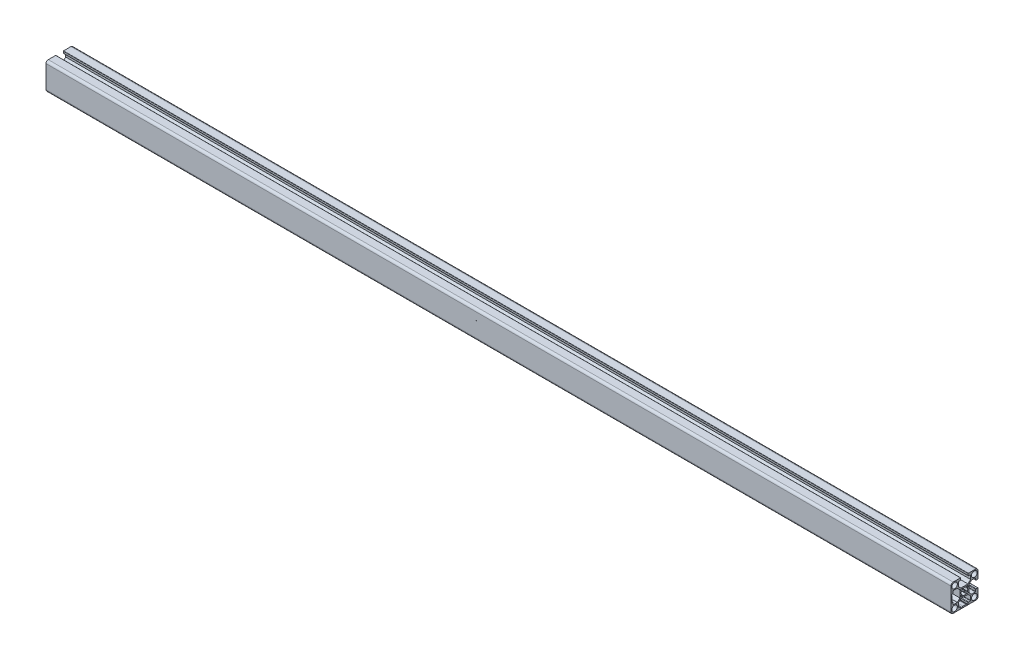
from build123d import *

# Parameters (mm, degrees)
MODEL7_R                            = 3.099999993
MODEL7_R_2                          = 3.1
F_30_SARJA_1_0007_30X30_2SS_1_DEPTH = 1000


with BuildPart() as part:
    # Model7 → 30-sarja 1.0007 30X30 2SS_1 (new body)
    with BuildSketch(Plane(origin=(0, 0, 0), x_dir=(0, 0, -1), z_dir=(1, 0, 0))):
        with BuildLine():
            Line((-4.099998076, 12.998506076), (-4.099998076, 14.698506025))
            ThreePointArc((-4.099998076, 14.698506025), (-4.187866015, 14.910638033), (-4.399998, 14.998506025))
            Line((-4.399998, 14.998506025), (-12.5, 14.998506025))
            ThreePointArc((-12.5, 14.998506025), (-14.267766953, 14.266272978), (-15, 12.498506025))
            Line((-15, 12.498506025), (-15, -12.501493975))
            ThreePointArc((-15, -12.501493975), (-14.267238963, -14.268295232), (-12.5, -15))
            Line((-12.5, -15), (12.5, -15))
            ThreePointArc((12.5, -15), (14.267238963, -14.268295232), (15, -12.501493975))
            Line((15, -12.501493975), (15, -4.401492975))
            ThreePointArc((15, -4.401492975), (14.912132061, -4.189360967), (14.700000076, -4.101492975))
            Line((14.700000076, -4.101492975), (12.999342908, -4.101492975))
            ThreePointArc((12.999342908, -4.101492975), (12.645789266, -4.247939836), (12.499342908, -4.601493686))
            Line((12.499342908, -4.601493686), (12.499342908, -6.500003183))
            ThreePointArc((12.499342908, -6.500003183), (12.411475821, -6.712132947), (12.199345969, -6.799999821))
            Line((12.199345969, -6.799999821), (7.859997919, -6.799999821))
            Line((7.859997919, -6.799999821), (4.999998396, -3.939999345))
            Line((4.999998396, -3.939999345), (4.999998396, 3.940000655))
            Line((4.999998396, 3.940000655), (7.859998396, 6.800000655))
            Line((7.859998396, 6.800000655), (12.20000515, 6.800000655))
            ThreePointArc((12.20000515, 6.800000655), (12.41213471, 6.712133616), (12.500001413, 6.500003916))
            Line((12.500001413, 6.500003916), (12.500001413, 4.598507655))
            ThreePointArc((12.500001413, 4.598507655), (12.646447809, 4.244953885), (13.000001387, 4.098507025))
            Line((13.000001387, 4.098507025), (14.70000213, 4.098507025))
            ThreePointArc((14.70000213, 4.098507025), (14.912661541, 4.186902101), (15, 4.399997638))
            Line((15, 4.399997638), (15, 12.5))
            ThreePointArc((15, 12.5), (14.267766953, 14.267766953), (12.5, 15))
            Line((12.5, 15), (4.400002, 15))
            ThreePointArc((4.400002, 15), (4.187869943, 14.912132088), (4.100001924, 14.700000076))
            Line((4.100001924, 14.700000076), (4.100001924, 13.000000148))
            ThreePointArc((4.100001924, 13.000000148), (4.246448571, 12.646446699), (4.600002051, 12.500000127))
            Line((4.600002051, 12.500000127), (6.500006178, 12.500000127))
            ThreePointArc((6.500006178, 12.500000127), (6.712664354, 12.411604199), (6.800000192, 12.198508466))
            Line((6.800000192, 12.198508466), (6.800000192, 7.858505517))
            Line((6.800000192, 7.858505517), (3.940000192, 4.998505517))
            Line((3.940000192, 4.998505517), (-3.939999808, 4.998505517))
            Line((-3.939999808, 4.998505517), (-6.799999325, 7.858506))
            Line((-6.799999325, 7.858506), (-6.799999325, 12.198508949))
            ThreePointArc((-6.799999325, 12.198508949), (-6.71213222, 12.41063888), (-6.500002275, 12.498505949))
            Line((-6.500002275, 12.498505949), (-4.599998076, 12.498505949))
            ThreePointArc((-4.599998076, 12.498505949), (-4.246444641, 12.644952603), (-4.099998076, 12.998506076))
        make_face()
        with Locations((10.899999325, -10.901493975)):
            Circle(MODEL7_R, mode=Mode.SUBTRACT)
        with Locations((-10.900000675, 10.898506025)):
            Circle(MODEL7_R_2, mode=Mode.SUBTRACT)
        with Locations((10.899999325, 10.898506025)):
            Circle(MODEL7_R, mode=Mode.SUBTRACT)
        with Locations((-10.900000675, -10.901493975)):
            Circle(MODEL7_R_2, mode=Mode.SUBTRACT)
        with BuildLine():
            Line((-3.363291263, -1.950571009), (-3.641600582, -2.228880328))
            Line((-3.641600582, -2.228880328), (-3.864716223, -3.278556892))
            ThreePointArc((-3.864716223, -3.278556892), (-3.725327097, -3.731700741), (-3.27028701, -3.864769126))
            Line((-3.27028701, -3.864769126), (-2.22738702, -3.64309389))
            Line((-2.22738702, -3.64309389), (-1.9490777, -3.364784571))
            ThreePointArc((-1.9490777, -3.364784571), (-1.78669092, -3.281069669), (-1.605855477, -3.307073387))
            ThreePointArc((-1.605855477, -3.307073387), (0.105812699, -3.674821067), (1.793484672, -3.209192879))
            Line((1.793484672, -3.209192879), (2.227385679, -3.643093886))
            Line((2.227385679, -3.643093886), (3.27028567, -3.864769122))
            ThreePointArc((3.27028567, -3.864769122), (3.725325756, -3.731700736), (3.864714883, -3.278556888))
            Line((3.864714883, -3.278556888), (3.641599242, -2.228880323))
            Line((3.641599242, -2.228880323), (3.363289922, -1.950571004))
            ThreePointArc((3.363289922, -1.950571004), (3.279575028, -1.788184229), (3.305578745, -1.607348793))
            ThreePointArc((3.305578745, -1.607348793), (3.675632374, 0.012150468), (3.294879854, 1.629167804))
            ThreePointArc((3.294879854, 1.629167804), (3.282114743, 1.798466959), (3.363289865, 1.947583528))
            Line((3.363289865, 1.947583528), (3.641599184, 2.225892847))
            Line((3.641599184, 2.225892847), (3.864714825, 3.275569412))
            ThreePointArc((3.864714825, 3.275569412), (3.699830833, 3.760183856), (3.195146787, 3.845810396))
            Line((3.195146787, 3.845810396), (2.227385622, 3.64010641))
            Line((2.227385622, 3.64010641), (1.949076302, 3.361797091))
            ThreePointArc((1.949076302, 3.361797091), (1.786665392, 3.278078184), (1.605810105, 3.30410748))
            ThreePointArc((1.605810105, 3.30410748), (-2.5227e-05, 3.673656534), (-1.605855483, 3.304085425))
            ThreePointArc((-1.605855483, 3.304085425), (-1.786690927, 3.278081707), (-1.949077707, 3.361796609))
            Line((-1.949077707, 3.361796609), (-2.227387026, 3.640105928))
            Line((-2.227387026, 3.640105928), (-3.270287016, 3.861781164))
            ThreePointArc((-3.270287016, 3.861781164), (-3.725327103, 3.728712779), (-3.86471623, 3.275568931))
            Line((-3.86471623, 3.275568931), (-3.641600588, 2.225892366))
            Line((-3.641600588, 2.225892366), (-3.363291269, 1.947583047))
            ThreePointArc((-3.363291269, 1.947583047), (-3.282116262, 1.798466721), (-3.294881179, 1.629167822))
            ThreePointArc((-3.294881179, 1.629167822), (-3.67563357, 0.012150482), (-3.305580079, -1.607348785))
            ThreePointArc((-3.305580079, -1.607348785), (-3.279576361, -1.788184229), (-3.363291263, -1.950571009))
        make_face(mode=Mode.SUBTRACT)
        with BuildLine():
            Line((4.600000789, -12.501496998), (6.500003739, -12.501496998))
            ThreePointArc((6.500003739, -12.501496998), (6.712133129, -12.413630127), (6.8, -12.201500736))
            Line((6.8, -12.201500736), (6.8, -7.861494))
            Line((6.8, -7.861494), (3.94, -5.001494))
            Line((3.94, -5.001494), (-3.94, -5.001494))
            Line((-3.94, -5.001494), (-6.8, -7.861494))
            Line((-6.8, -7.861494), (-6.8, -12.201500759))
            ThreePointArc((-6.8, -12.201500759), (-6.712132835, -12.413630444), (-6.500002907, -12.50149702))
            Line((-6.500002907, -12.50149702), (-4.600001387, -12.50149702))
            ThreePointArc((-4.600001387, -12.50149702), (-4.246447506, -12.64794412), (-4.100001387, -13.001498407))
            Line((-4.100001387, -13.001498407), (-4.100001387, -14.701500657))
            Line((-4.100001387, -14.701500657), (-3.800001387, -14.701500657))
            Line((-3.800001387, -14.701500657), (-3.332237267, -14.233735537))
            ThreePointArc((-3.332237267, -14.233735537), (-2.521178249, -13.691802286), (-1.564468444, -13.501500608))
            Line((-1.564468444, -13.501500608), (1.56449461, -13.501500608))
            ThreePointArc((1.56449461, -13.501500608), (2.521240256, -13.691817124), (3.332318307, -14.233790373))
            Line((3.332318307, -14.233790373), (3.799998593, -14.701500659))
            Line((3.799998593, -14.701500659), (4.100003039, -14.701500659))
            Line((4.100003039, -14.701500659), (4.100003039, -13.001494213))
            ThreePointArc((4.100003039, -13.001494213), (4.246449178, -12.647942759), (4.600000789, -12.501496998))
        make_face(mode=Mode.SUBTRACT)
        with BuildLine():
            Line((-12.500881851, -4.602385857), (-12.500881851, -6.503882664))
            ThreePointArc((-12.500881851, -6.503882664), (-12.413014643, -6.716011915), (-12.200885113, -6.803878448))
            Line((-12.200885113, -6.803878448), (-7.860878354, -6.803878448))
            Line((-7.860878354, -6.803878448), (-5.000878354, -3.943878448))
            Line((-5.000878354, -3.943878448), (-5.000878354, 3.936121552))
            Line((-5.000878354, 3.936121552), (-7.860878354, 6.796121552))
            Line((-7.860878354, 6.796121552), (-12.200885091, 6.796121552))
            ThreePointArc((-12.200885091, 6.796121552), (-12.418905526, 6.708238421), (-12.506639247, 6.490157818))
            Line((-12.506639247, 6.490157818), (-12.506639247, 4.591656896))
            ThreePointArc((-12.506639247, 4.591656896), (-12.652774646, 4.238415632), (-13.005758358, 4.091659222))
            Line((-13.005758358, 4.091659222), (-14.695530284, 4.091659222))
            Line((-14.695530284, 4.091659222), (-14.695530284, 3.796406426))
            Line((-14.695530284, 3.796406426), (-14.227822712, 3.328728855))
            ThreePointArc((-14.227822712, 3.328728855), (-13.691316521, 2.517484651), (-13.504989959, 1.562896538))
            Line((-13.504989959, 1.562896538), (-13.504989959, -1.567103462))
            ThreePointArc((-13.504989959, -1.567103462), (-13.692958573, -2.522568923), (-14.231706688, -3.333739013))
            Line((-14.231706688, -3.333739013), (-14.699472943, -3.80150378))
            Line((-14.699472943, -3.80150378), (-14.700001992, -4.101503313))
            Line((-14.700001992, -4.101503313), (-13.000881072, -4.101503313))
            ThreePointArc((-13.000881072, -4.101503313), (-12.647015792, -4.248262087), (-12.500881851, -4.602385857))
        make_face(mode=Mode.SUBTRACT)
    extrude(amount=F_30_SARJA_1_0007_30X30_2SS_1_DEPTH)


solid = part.part
